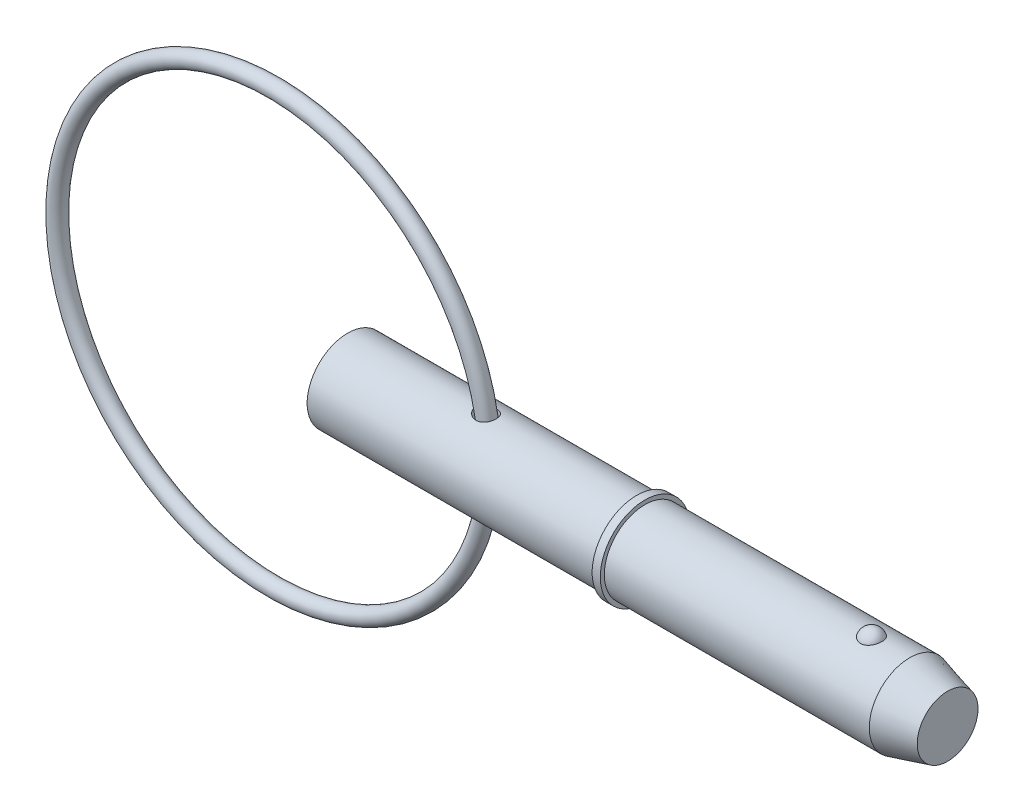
ISO-10303-21;
HEADER;
FILE_DESCRIPTION(('STEP AP214'),'2;1');
FILE_NAME('part.step','',(''),(''),'','','');
FILE_SCHEMA(('AUTOMOTIVE_DESIGN { 1 0 10303 214 1 1 1 1 }'));
ENDSEC;
DATA;
#1=APPLICATION_CONTEXT('core data for automotive mechanical design processes');
#2=APPLICATION_PROTOCOL_DEFINITION('international standard','automotive_design',2000,#1);
#3=PRODUCT_CONTEXT('',#1,'mechanical');
#4=PRODUCT('Part','Part','',(#3));
#5=PRODUCT_RELATED_PRODUCT_CATEGORY('part','',(#4));
#6=PRODUCT_DEFINITION_FORMATION('','',#4);
#7=PRODUCT_DEFINITION_CONTEXT('part definition',#1,'design');
#8=PRODUCT_DEFINITION('design','',#6,#7);
#9=PRODUCT_DEFINITION_SHAPE('','',#8);
#10=(LENGTH_UNIT() NAMED_UNIT(*) SI_UNIT(.MILLI.,.METRE.));
#11=(NAMED_UNIT(*) PLANE_ANGLE_UNIT() SI_UNIT($,.RADIAN.));
#12=(NAMED_UNIT(*) SI_UNIT($,.STERADIAN.) SOLID_ANGLE_UNIT());
#13=UNCERTAINTY_MEASURE_WITH_UNIT(LENGTH_MEASURE(1.E-05),#10,'distance_accuracy_value','');
#14=(GEOMETRIC_REPRESENTATION_CONTEXT(3) GLOBAL_UNCERTAINTY_ASSIGNED_CONTEXT((#13)) GLOBAL_UNIT_ASSIGNED_CONTEXT((#10,
#11,#12)) REPRESENTATION_CONTEXT('',''));
#15=CARTESIAN_POINT('',(0.,0.,0.));
#16=DIRECTION('',(0.,0.,1.));
#17=DIRECTION('',(1.,0.,0.));
#18=AXIS2_PLACEMENT_3D('',#15,#16,#17);
#19=CARTESIAN_POINT('',(-4.3552379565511,0.,0.));
#20=DIRECTION('',(0.,0.,1.));
#21=DIRECTION('',(1.,0.,0.));
#22=AXIS2_PLACEMENT_3D('',#19,#20,#21);
#23=TOROIDAL_SURFACE('',#22,12.7,0.476000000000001);
#24=CARTESIAN_POINT('',(8.8207620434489,0.,0.));
#25=VERTEX_POINT('',#24);
#26=VERTEX_LOOP('',#25);
#27=FACE_BOUND('',#26,.T.);
#28=ADVANCED_FACE('P0_F12',(#27),#23,.T.);
#29=CLOSED_SHELL('',(#28));
#30=MANIFOLD_SOLID_BREP('P0_B1',#29);
#31=CARTESIAN_POINT('',(0.,0.,0.));
#32=DIRECTION('',(1.,0.,0.));
#33=DIRECTION('',(0.,0.,-1.));
#34=AXIS2_PLACEMENT_3D('',#31,#32,#33);
#35=CYLINDRICAL_SURFACE('',#34,2.38);
#36=CARTESIAN_POINT('',(7.58975148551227,2.36313886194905,-0.28279801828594));
#37=CARTESIAN_POINT('',(7.6071494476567,2.3595137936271,-0.313086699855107));
#38=CARTESIAN_POINT('',(7.62722970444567,2.35548219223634,-0.341811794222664));
#39=CARTESIAN_POINT('',(7.6719764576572,2.34708028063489,-0.395416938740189));
#40=CARTESIAN_POINT('',(7.69665038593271,2.34270942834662,-0.420290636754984));
#41=CARTESIAN_POINT('',(7.74972661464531,2.33413422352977,-0.465561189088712));
#42=CARTESIAN_POINT('',(7.77811964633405,2.3299294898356,-0.485968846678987));
#43=CARTESIAN_POINT('',(7.83790446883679,2.32214293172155,-0.521911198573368));
#44=CARTESIAN_POINT('',(7.86929545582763,2.31856094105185,-0.537447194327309));
#45=CARTESIAN_POINT('',(7.93519088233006,2.31234960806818,-0.563583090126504));
#46=CARTESIAN_POINT('',(7.96975762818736,2.30974952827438,-0.574033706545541));
#47=CARTESIAN_POINT('',(8.04024488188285,2.3060008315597,-0.588914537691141));
#48=CARTESIAN_POINT('',(8.07616512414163,2.3048519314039,-0.593345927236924));
#49=CARTESIAN_POINT('',(8.14695871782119,2.30420789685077,-0.595841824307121));
#50=CARTESIAN_POINT('',(8.18182355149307,2.30465507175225,-0.594128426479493));
#51=CARTESIAN_POINT('',(8.25068512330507,2.30705630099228,-0.584734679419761));
#52=CARTESIAN_POINT('',(8.28468213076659,2.30900988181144,-0.577056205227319));
#53=CARTESIAN_POINT('',(8.34906698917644,2.31406811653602,-0.556412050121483));
#54=CARTESIAN_POINT('',(8.37955021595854,2.31711087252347,-0.543727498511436));
#55=CARTESIAN_POINT('',(8.43786372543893,2.32400968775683,-0.513438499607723));
#56=CARTESIAN_POINT('',(8.46569411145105,2.32786571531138,-0.495834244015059));
#57=CARTESIAN_POINT('',(8.51768626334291,2.33591620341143,-0.456393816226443));
#58=CARTESIAN_POINT('',(8.54188060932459,2.34010706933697,-0.434599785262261));
#59=CARTESIAN_POINT('',(8.58630752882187,2.34840208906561,-0.387277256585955));
#60=CARTESIAN_POINT('',(8.60653982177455,2.35250623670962,-0.361748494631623));
#61=CARTESIAN_POINT('',(8.64282785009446,2.36024850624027,-0.307237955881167));
#62=CARTESIAN_POINT('',(8.65881497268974,2.36387854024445,-0.278209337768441));
#63=CARTESIAN_POINT('',(8.68580879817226,2.37020506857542,-0.217827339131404));
#64=CARTESIAN_POINT('',(8.69681534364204,2.37290153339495,-0.18647388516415));
#65=CARTESIAN_POINT('',(8.71363969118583,2.37708738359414,-0.122079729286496));
#66=CARTESIAN_POINT('',(8.71941899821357,2.37856780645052,-0.0890283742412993));
#67=CARTESIAN_POINT('',(8.72550469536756,2.38012793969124,-0.0223933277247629));
#68=CARTESIAN_POINT('',(8.72581115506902,2.38020766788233,0.0111903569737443));
#69=CARTESIAN_POINT('',(8.72094957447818,2.37895941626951,0.0778527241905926));
#70=CARTESIAN_POINT('',(8.71579439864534,2.377634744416,0.110932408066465));
#71=CARTESIAN_POINT('',(8.70015845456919,2.37372548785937,0.175731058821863));
#72=CARTESIAN_POINT('',(8.68967753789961,2.37114086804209,0.207449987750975));
#73=CARTESIAN_POINT('',(8.66363496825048,2.36498751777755,0.268667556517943));
#74=CARTESIAN_POINT('',(8.64806773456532,2.36141770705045,0.298163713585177));
#75=CARTESIAN_POINT('',(8.61223946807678,2.35368505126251,0.354067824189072));
#76=CARTESIAN_POINT('',(8.59197833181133,2.34952219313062,0.380475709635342));
#77=CARTESIAN_POINT('',(8.54726357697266,2.34106443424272,0.429460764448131));
#78=CARTESIAN_POINT('',(8.52280850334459,2.33676948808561,0.452036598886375));
#79=CARTESIAN_POINT('',(8.47035669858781,2.3285376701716,0.49269040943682));
#80=CARTESIAN_POINT('',(8.44236041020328,2.32460075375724,0.510768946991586));
#81=CARTESIAN_POINT('',(8.38398546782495,2.31758529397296,0.541708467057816));
#82=CARTESIAN_POINT('',(8.35364184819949,2.31449641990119,0.554633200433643));
#83=CARTESIAN_POINT('',(8.29114127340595,2.30945817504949,0.575253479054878));
#84=CARTESIAN_POINT('',(8.25898451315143,2.30750868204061,0.582949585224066));
#85=CARTESIAN_POINT('',(8.19412910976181,2.30496641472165,0.592921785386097));
#86=CARTESIAN_POINT('',(8.161439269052,2.30436008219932,0.595252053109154));
#87=CARTESIAN_POINT('',(8.09610955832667,2.30450130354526,0.594704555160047));
#88=CARTESIAN_POINT('',(8.0634696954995,2.30524903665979,0.591826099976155));
#89=CARTESIAN_POINT('',(7.99825736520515,2.30802121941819,0.580921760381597));
#90=CARTESIAN_POINT('',(7.96570822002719,2.31007800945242,0.572765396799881));
#91=CARTESIAN_POINT('',(7.90235775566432,2.31524655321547,0.551500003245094));
#92=CARTESIAN_POINT('',(7.87155698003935,2.31835863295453,0.53838944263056));
#93=CARTESIAN_POINT('',(7.81084906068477,2.32548378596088,0.506755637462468));
#94=CARTESIAN_POINT('',(7.78107737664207,2.32953608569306,0.487980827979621));
#95=CARTESIAN_POINT('',(7.72506412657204,2.33797565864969,0.445793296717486));
#96=CARTESIAN_POINT('',(7.69882353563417,2.34236302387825,0.422379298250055));
#97=CARTESIAN_POINT('',(7.65019002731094,2.35106473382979,0.370927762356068));
#98=CARTESIAN_POINT('',(7.62788209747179,2.35537598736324,0.342808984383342));
#99=CARTESIAN_POINT('',(7.58861130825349,2.36331071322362,0.282967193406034));
#100=CARTESIAN_POINT('',(7.57164595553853,2.3669345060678,0.251245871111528));
#101=CARTESIAN_POINT('',(7.54465876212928,2.37284705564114,0.187017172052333));
#102=CARTESIAN_POINT('',(7.5342924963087,2.37520082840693,0.154660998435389));
#103=CARTESIAN_POINT('',(7.51954252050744,2.37858198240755,0.0885446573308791));
#104=CARTESIAN_POINT('',(7.51515589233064,2.37961001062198,0.0547851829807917));
#105=CARTESIAN_POINT('',(7.51270681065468,2.38018226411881,-0.0102367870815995));
#106=CARTESIAN_POINT('',(7.51416323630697,2.37983937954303,-0.0414812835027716));
#107=CARTESIAN_POINT('',(7.52225907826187,2.37796025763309,-0.103234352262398));
#108=CARTESIAN_POINT('',(7.52889419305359,2.37642501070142,-0.133743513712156));
#109=CARTESIAN_POINT('',(7.54430841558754,2.37294751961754,-0.184277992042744));
#110=CARTESIAN_POINT('',(7.55185254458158,2.37126438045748,-0.204709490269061));
#111=CARTESIAN_POINT('',(7.56916989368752,2.36748607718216,-0.244561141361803));
#112=CARTESIAN_POINT('',(7.57894307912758,2.36539091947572,-0.263981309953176));
#113=CARTESIAN_POINT('',(7.58975148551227,2.36313886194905,-0.28279801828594));
#114=B_SPLINE_CURVE_WITH_KNOTS('',3,(#36,#37,#38,#39,#40,#41,#42,#43,#44,#45,#46,#47,#48,#49,
#50,#51,#52,#53,#54,#55,#56,#57,#58,#59,#60,#61,#62,#63,#64,#65,#66,#67,#68,#69,#70,#71,#72,#73,
#74,#75,#76,#77,#78,#79,#80,#81,#82,#83,#84,#85,#86,#87,#88,#89,#90,#91,#92,#93,#94,#95,#96,#97,
#98,#99,#100,#101,#102,#103,#104,#105,#106,#107,#108,#109,#110,#111,#112,#113),.UNSPECIFIED.,
.T.,.F.,(4,2,2,2,2,2,2,2,2,2,2,2,2,2,2,2,2,2,2,2,2,2,2,2,2,2,2,2,2,2,2,2,2,2,2,2,2,2,4),(0.,
0.105267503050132,0.210706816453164,0.315888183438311,0.421041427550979,0.529118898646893,
0.637175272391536,0.741366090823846,0.84552417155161,0.944516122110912,1.04350421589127,
1.14154435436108,1.23959143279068,1.33913812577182,1.43868796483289,1.53896508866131,
1.63924093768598,1.73928111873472,1.83932408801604,1.93947719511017,2.03963250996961,
2.13982264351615,2.24000026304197,2.33889712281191,2.43778337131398,2.53566679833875,
2.63356318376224,2.73397729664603,2.83442245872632,2.94022921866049,3.04606513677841,
3.15396441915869,3.26181327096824,3.36343346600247,3.46500405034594,3.55839004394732,
3.65169855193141,3.71709653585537,3.78249350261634),.UNSPECIFIED.);
#115=CARTESIAN_POINT('',(7.58975148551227,2.36313886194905,-0.28279801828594));
#116=VERTEX_POINT('',#115);
#117=EDGE_CURVE('P1_E42',#116,#116,#114,.T.);
#118=ORIENTED_EDGE('',*,*,#117,.T.);
#119=EDGE_LOOP('',(#118));
#120=FACE_BOUND('',#119,.T.);
#121=CARTESIAN_POINT('',(0.,0.,0.));
#122=DIRECTION('',(1.,0.,0.));
#123=DIRECTION('',(0.,0.,-1.));
#124=AXIS2_PLACEMENT_3D('',#121,#122,#123);
#125=CIRCLE('',#124,2.38);
#126=CARTESIAN_POINT('',(0.,0.,-2.38));
#127=VERTEX_POINT('',#126);
#128=EDGE_CURVE('P1_E9',#127,#127,#125,.T.);
#129=ORIENTED_EDGE('',*,*,#128,.T.);
#130=EDGE_LOOP('',(#129));
#131=FACE_BOUND('',#130,.T.);
#132=CARTESIAN_POINT('',(16.974,0.,0.));
#133=DIRECTION('',(1.,0.,0.));
#134=DIRECTION('',(0.,0.,-1.));
#135=AXIS2_PLACEMENT_3D('',#132,#133,#134);
#136=CIRCLE('',#135,2.38);
#137=CARTESIAN_POINT('',(16.974,0.,-2.38));
#138=VERTEX_POINT('',#137);
#139=EDGE_CURVE('P1_E25',#138,#138,#136,.T.);
#140=ORIENTED_EDGE('',*,*,#139,.F.);
#141=EDGE_LOOP('',(#140));
#142=FACE_BOUND('',#141,.T.);
#143=CARTESIAN_POINT('',(7.58975148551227,-2.36313886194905,-0.28279801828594));
#144=CARTESIAN_POINT('',(7.57418830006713,-2.3663814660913,-0.255701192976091));
#145=CARTESIAN_POINT('',(7.56076205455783,-2.36930044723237,-0.227336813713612));
#146=CARTESIAN_POINT('',(7.53869583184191,-2.37419355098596,-0.168724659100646));
#147=CARTESIAN_POINT('',(7.53005409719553,-2.37616802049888,-0.138477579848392));
#148=CARTESIAN_POINT('',(7.5179268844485,-2.37895970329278,-0.0768369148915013));
#149=CARTESIAN_POINT('',(7.51445304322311,-2.37977430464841,-0.0454409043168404));
#150=CARTESIAN_POINT('',(7.51287156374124,-2.38014365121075,0.0174935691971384));
#151=CARTESIAN_POINT('',(7.51476360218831,-2.37969847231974,0.0490320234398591));
#152=CARTESIAN_POINT('',(7.52368198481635,-2.37763188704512,0.11036883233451));
#153=CARTESIAN_POINT('',(7.53055435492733,-2.37604576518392,0.140191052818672));
#154=CARTESIAN_POINT('',(7.54895588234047,-2.37190466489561,0.19828599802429));
#155=CARTESIAN_POINT('',(7.56048572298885,-2.36934954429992,0.226558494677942));
#156=CARTESIAN_POINT('',(7.58819257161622,-2.36343089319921,0.281762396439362));
#157=CARTESIAN_POINT('',(7.60450508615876,-2.36004434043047,0.308623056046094));
#158=CARTESIAN_POINT('',(7.64106334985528,-2.35283977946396,0.359451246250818));
#159=CARTESIAN_POINT('',(7.6613104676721,-2.34902162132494,0.383417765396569));
#160=CARTESIAN_POINT('',(7.70695754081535,-2.34099193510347,0.429832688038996));
#161=CARTESIAN_POINT('',(7.73264232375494,-2.33677362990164,0.45200004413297));
#162=CARTESIAN_POINT('',(7.78725305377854,-2.32868304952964,0.491988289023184));
#163=CARTESIAN_POINT('',(7.81618023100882,-2.32481090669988,0.509807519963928));
#164=CARTESIAN_POINT('',(7.87824201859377,-2.31763132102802,0.541539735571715));
#165=CARTESIAN_POINT('',(7.91152093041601,-2.31436703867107,0.555181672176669));
#166=CARTESIAN_POINT('',(7.97999150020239,-2.30909873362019,0.576703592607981));
#167=CARTESIAN_POINT('',(8.01518292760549,-2.30709455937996,0.584584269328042));
#168=CARTESIAN_POINT('',(8.08580757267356,-2.30465743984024,0.594119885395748));
#169=CARTESIAN_POINT('',(8.12122470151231,-2.30419653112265,0.595885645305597));
#170=CARTESIAN_POINT('',(8.19181659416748,-2.30486796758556,0.593284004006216));
#171=CARTESIAN_POINT('',(8.22699144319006,-2.30599972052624,0.588918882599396));
#172=CARTESIAN_POINT('',(8.29408987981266,-2.30963941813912,0.574470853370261));
#173=CARTESIAN_POINT('',(8.32608666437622,-2.31207030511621,0.564707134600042));
#174=CARTESIAN_POINT('',(8.38787213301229,-2.31798180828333,0.539927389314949));
#175=CARTESIAN_POINT('',(8.41766103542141,-2.32146232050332,0.524911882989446));
#176=CARTESIAN_POINT('',(8.47353661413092,-2.32898511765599,0.490439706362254));
#177=CARTESIAN_POINT('',(8.49969091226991,-2.33301318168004,0.471089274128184));
#178=CARTESIAN_POINT('',(8.54838372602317,-2.34124455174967,0.428307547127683));
#179=CARTESIAN_POINT('',(8.57092204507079,-2.34544786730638,0.404876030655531));
#180=CARTESIAN_POINT('',(8.61207557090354,-2.35362667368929,0.354267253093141));
#181=CARTESIAN_POINT('',(8.63063940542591,-2.35759874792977,0.3270476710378));
#182=CARTESIAN_POINT('',(8.66303816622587,-2.36482918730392,0.269839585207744));
#183=CARTESIAN_POINT('',(8.67687284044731,-2.36808751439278,0.23985093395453));
#184=CARTESIAN_POINT('',(8.69960621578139,-2.37357381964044,0.177579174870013));
#185=CARTESIAN_POINT('',(8.7084473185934,-2.3757897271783,0.145273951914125));
#186=CARTESIAN_POINT('',(8.72072898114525,-2.37889592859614,0.0795911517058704));
#187=CARTESIAN_POINT('',(8.72416959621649,-2.37978623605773,0.0462135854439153));
#188=CARTESIAN_POINT('',(8.72556332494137,-2.38014500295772,-0.0206284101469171));
#189=CARTESIAN_POINT('',(8.72352221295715,-2.37961495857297,-0.0540927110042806));
#190=CARTESIAN_POINT('',(8.71401607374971,-2.37719332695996,-0.12019135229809));
#191=CARTESIAN_POINT('',(8.70655097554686,-2.37530172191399,-0.152825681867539));
#192=CARTESIAN_POINT('',(8.68638818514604,-2.37036240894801,-0.216324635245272));
#193=CARTESIAN_POINT('',(8.67369312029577,-2.36731528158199,-0.247190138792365));
#194=CARTESIAN_POINT('',(8.64338307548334,-2.36039503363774,-0.306303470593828));
#195=CARTESIAN_POINT('',(8.62576790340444,-2.35652188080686,-0.334551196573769));
#196=CARTESIAN_POINT('',(8.58601062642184,-2.34836581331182,-0.387689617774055));
#197=CARTESIAN_POINT('',(8.56385884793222,-2.34408203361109,-0.412572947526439));
#198=CARTESIAN_POINT('',(8.51562034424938,-2.33559361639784,-0.458194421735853));
#199=CARTESIAN_POINT('',(8.4895339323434,-2.33138897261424,-0.478932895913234));
#200=CARTESIAN_POINT('',(8.43437902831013,-2.32357677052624,-0.515498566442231));
#201=CARTESIAN_POINT('',(8.40533919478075,-2.31996422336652,-0.531367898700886));
#202=CARTESIAN_POINT('',(8.3449114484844,-2.31370413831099,-0.557997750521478));
#203=CARTESIAN_POINT('',(8.31352388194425,-2.31105645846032,-0.568759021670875));
#204=CARTESIAN_POINT('',(8.24979053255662,-2.30704987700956,-0.584798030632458));
#205=CARTESIAN_POINT('',(8.2174653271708,-2.30567279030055,-0.590153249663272));
#206=CARTESIAN_POINT('',(8.15234941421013,-2.3042717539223,-0.595600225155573));
#207=CARTESIAN_POINT('',(8.11955868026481,-2.30424788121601,-0.595691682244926));
#208=CARTESIAN_POINT('',(8.05396041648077,-2.30553291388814,-0.590698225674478));
#209=CARTESIAN_POINT('',(8.02115865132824,-2.30685983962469,-0.585543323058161));
#210=CARTESIAN_POINT('',(7.95682322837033,-2.31069752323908,-0.570209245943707));
#211=CARTESIAN_POINT('',(7.9252899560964,-2.31320863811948,-0.560028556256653));
#212=CARTESIAN_POINT('',(7.86270639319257,-2.31927991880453,-0.534343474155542));
#213=CARTESIAN_POINT('',(7.83175966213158,-2.32288638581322,-0.51859766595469));
#214=CARTESIAN_POINT('',(7.7728658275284,-2.33068292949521,-0.48234820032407));
#215=CARTESIAN_POINT('',(7.74491930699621,-2.33487311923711,-0.461843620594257));
#216=CARTESIAN_POINT('',(7.69322838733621,-2.34330635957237,-0.416926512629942));
#217=CARTESIAN_POINT('',(7.66941974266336,-2.34754724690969,-0.392587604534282));
#218=CARTESIAN_POINT('',(7.62614930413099,-2.35569931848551,-0.340264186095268));
#219=CARTESIAN_POINT('',(7.60668542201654,-2.35961066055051,-0.312281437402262));
#220=CARTESIAN_POINT('',(7.58975148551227,-2.36313886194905,-0.28279801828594));
#221=B_SPLINE_CURVE_WITH_KNOTS('',3,(#143,#144,#145,#146,#147,#148,#149,#150,#151,#152,#153,
#154,#155,#156,#157,#158,#159,#160,#161,#162,#163,#164,#165,#166,#167,#168,#169,#170,#171,#172,
#173,#174,#175,#176,#177,#178,#179,#180,#181,#182,#183,#184,#185,#186,#187,#188,#189,#190,#191,
#192,#193,#194,#195,#196,#197,#198,#199,#200,#201,#202,#203,#204,#205,#206,#207,#208,#209,#210,
#211,#212,#213,#214,#215,#216,#217,#218,#219,#220),.UNSPECIFIED.,.T.,.F.,(4,2,2,2,2,2,2,2,2,2,2,
2,2,2,2,2,2,2,2,2,2,2,2,2,2,2,2,2,2,2,2,2,2,2,2,2,2,2,4),(0.,0.0941407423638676,
0.188246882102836,0.282564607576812,0.376876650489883,0.468390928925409,0.559918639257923,
0.654342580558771,0.748799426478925,0.850921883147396,0.953083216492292,1.06090345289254,
1.16871071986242,1.2745536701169,1.38035727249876,1.48048681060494,1.58060643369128,
1.67849861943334,1.7763961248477,1.87549138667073,1.97459192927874,2.07481335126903,
2.17503374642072,2.27514861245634,2.37526478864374,2.47533073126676,2.57540058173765,
2.67568607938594,2.77596359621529,2.87534713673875,2.97471604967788,3.07263964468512,
3.17056880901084,3.26982174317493,3.36910461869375,3.47336737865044,3.57765036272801,
3.68013205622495,3.78256438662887),.UNSPECIFIED.);
#222=CARTESIAN_POINT('',(7.58975148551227,-2.36313886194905,-0.28279801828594));
#223=VERTEX_POINT('',#222);
#224=EDGE_CURVE('P1_E17',#223,#223,#221,.T.);
#225=ORIENTED_EDGE('',*,*,#224,.T.);
#226=EDGE_LOOP('',(#225));
#227=FACE_BOUND('',#226,.T.);
#228=ADVANCED_FACE('P1_F13',(#120,#131,#142,#227),#35,.T.);
#229=CARTESIAN_POINT('',(0.,0.,0.));
#230=DIRECTION('',(1.,0.,0.));
#231=DIRECTION('',(0.,0.,-1.));
#232=AXIS2_PLACEMENT_3D('',#229,#230,#231);
#233=CYLINDRICAL_SURFACE('',#232,2.38);
#234=CARTESIAN_POINT('',(33.0094297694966,0.,0.));
#235=DIRECTION('',(1.,0.,0.));
#236=DIRECTION('',(0.,0.,-1.));
#237=AXIS2_PLACEMENT_3D('',#234,#235,#236);
#238=CIRCLE('',#237,2.38);
#239=CARTESIAN_POINT('',(33.0094297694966,0.,-2.38));
#240=VERTEX_POINT('',#239);
#241=EDGE_CURVE('P1_E99',#240,#240,#238,.T.);
#242=ORIENTED_EDGE('',*,*,#241,.F.);
#243=EDGE_LOOP('',(#242));
#244=FACE_BOUND('',#243,.T.);
#245=CARTESIAN_POINT('',(17.45,0.,0.));
#246=DIRECTION('',(1.,0.,0.));
#247=DIRECTION('',(0.,0.,-1.));
#248=AXIS2_PLACEMENT_3D('',#245,#246,#247);
#249=CIRCLE('',#248,2.38);
#250=CARTESIAN_POINT('',(17.45,0.,-2.38));
#251=VERTEX_POINT('',#250);
#252=EDGE_CURVE('P1_E96',#251,#251,#249,.T.);
#253=ORIENTED_EDGE('',*,*,#252,.T.);
#254=EDGE_LOOP('',(#253));
#255=FACE_BOUND('',#254,.T.);
#256=CARTESIAN_POINT('',(30.7634492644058,2.2921568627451,0.640637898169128));
#257=CARTESIAN_POINT('',(30.7303559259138,2.29215737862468,0.640637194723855));
#258=CARTESIAN_POINT('',(30.6972546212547,2.29293179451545,0.637884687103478));
#259=CARTESIAN_POINT('',(30.6320176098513,2.29594030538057,0.626968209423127));
#260=CARTESIAN_POINT('',(30.5998823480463,2.29817506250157,0.618801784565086));
#261=CARTESIAN_POINT('',(30.5375402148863,2.30384308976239,0.597351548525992));
#262=CARTESIAN_POINT('',(30.5073305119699,2.30727454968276,0.584075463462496));
#263=CARTESIAN_POINT('',(30.4495674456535,2.31495941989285,0.55282960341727));
#264=CARTESIAN_POINT('',(30.4220141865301,2.31921286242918,0.534859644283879));
#265=CARTESIAN_POINT('',(30.3695938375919,2.32820213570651,0.494282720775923));
#266=CARTESIAN_POINT('',(30.3448050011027,2.33294694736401,0.47157679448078));
#267=CARTESIAN_POINT('',(30.2992169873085,2.34234144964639,0.422446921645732));
#268=CARTESIAN_POINT('',(30.2784185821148,2.34699112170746,0.396022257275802));
#269=CARTESIAN_POINT('',(30.2403580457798,2.35593942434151,0.338855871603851));
#270=CARTESIAN_POINT('',(30.2233051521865,2.36021170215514,0.307970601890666));
#271=CARTESIAN_POINT('',(30.1943607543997,2.3677057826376,0.243750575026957));
#272=CARTESIAN_POINT('',(30.1824701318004,2.37092740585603,0.210415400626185));
#273=CARTESIAN_POINT('',(30.1638076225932,2.37606901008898,0.141189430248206));
#274=CARTESIAN_POINT('',(30.1571956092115,2.37794816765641,0.105252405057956));
#275=CARTESIAN_POINT('',(30.1498095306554,2.38005135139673,0.0327351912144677));
#276=CARTESIAN_POINT('',(30.1490358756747,2.38027526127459,-0.00384504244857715));
#277=CARTESIAN_POINT('',(30.1533628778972,2.37903842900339,-0.0769838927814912));
#278=CARTESIAN_POINT('',(30.1585202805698,2.37756141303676,-0.113538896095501));
#279=CARTESIAN_POINT('',(30.1747013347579,2.37305303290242,-0.18522921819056));
#280=CARTESIAN_POINT('',(30.1857251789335,2.37002161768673,-0.22036449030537));
#281=CARTESIAN_POINT('',(30.2133977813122,2.36273722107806,-0.288156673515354));
#282=CARTESIAN_POINT('',(30.2300389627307,2.35848588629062,-0.320816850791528));
#283=CARTESIAN_POINT('',(30.2685984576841,2.34923130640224,-0.382744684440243));
#284=CARTESIAN_POINT('',(30.290516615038,2.34422808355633,-0.412012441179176));
#285=CARTESIAN_POINT('',(30.3387549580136,2.33412555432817,-0.465830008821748));
#286=CARTESIAN_POINT('',(30.365002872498,2.32902887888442,-0.490444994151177));
#287=CARTESIAN_POINT('',(30.4214769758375,2.31926941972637,-0.534700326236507));
#288=CARTESIAN_POINT('',(30.451702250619,2.3146065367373,-0.554341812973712));
#289=CARTESIAN_POINT('',(30.5140618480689,2.30645675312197,-0.587312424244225));
#290=CARTESIAN_POINT('',(30.5460780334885,2.30293152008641,-0.600855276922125));
#291=CARTESIAN_POINT('',(30.6120795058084,2.29725171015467,-0.622220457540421));
#292=CARTESIAN_POINT('',(30.6460641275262,2.29509667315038,-0.630044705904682));
#293=CARTESIAN_POINT('',(30.713299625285,2.29249264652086,-0.639452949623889));
#294=CARTESIAN_POINT('',(30.7465087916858,2.29196755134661,-0.641315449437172));
#295=CARTESIAN_POINT('',(30.812763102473,2.29246849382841,-0.639522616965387));
#296=CARTESIAN_POINT('',(30.8458082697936,2.29349430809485,-0.635868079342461));
#297=CARTESIAN_POINT('',(30.9101025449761,2.29694059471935,-0.623301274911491));
#298=CARTESIAN_POINT('',(30.9413744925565,2.29933234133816,-0.614497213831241));
#299=CARTESIAN_POINT('',(31.0019952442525,2.30522511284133,-0.592006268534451));
#300=CARTESIAN_POINT('',(31.0313438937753,2.30872622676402,-0.578318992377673));
#301=CARTESIAN_POINT('',(31.0880369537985,2.31655795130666,-0.546112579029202));
#302=CARTESIAN_POINT('',(31.115320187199,2.32090569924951,-0.527490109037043));
#303=CARTESIAN_POINT('',(31.1664904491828,2.32992206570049,-0.486117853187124));
#304=CARTESIAN_POINT('',(31.1903767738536,2.33459075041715,-0.463367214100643));
#305=CARTESIAN_POINT('',(31.2352722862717,2.34399834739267,-0.413220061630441));
#306=CARTESIAN_POINT('',(31.2560972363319,2.34873051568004,-0.385657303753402));
#307=CARTESIAN_POINT('',(31.293056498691,2.35754932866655,-0.327455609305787));
#308=CARTESIAN_POINT('',(31.3091898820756,2.36163584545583,-0.296816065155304));
#309=CARTESIAN_POINT('',(31.3369822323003,2.36889321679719,-0.232047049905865));
#310=CARTESIAN_POINT('',(31.3484450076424,2.37202275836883,-0.197828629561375));
#311=CARTESIAN_POINT('',(31.3657523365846,2.37681926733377,-0.127900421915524));
#312=CARTESIAN_POINT('',(31.3715962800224,2.37848607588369,-0.0921904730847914));
#313=CARTESIAN_POINT('',(31.377605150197,2.38020024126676,-0.0196348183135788));
#314=CARTESIAN_POINT('',(31.3776704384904,2.38021918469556,0.0172198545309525));
#315=CARTESIAN_POINT('',(31.3718689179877,2.37856356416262,0.0904219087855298));
#316=CARTESIAN_POINT('',(31.3660018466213,2.37688892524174,0.126769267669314));
#317=CARTESIAN_POINT('',(31.348425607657,2.37201688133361,0.198028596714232));
#318=CARTESIAN_POINT('',(31.336699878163,2.36881516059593,0.232936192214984));
#319=CARTESIAN_POINT('',(31.3076354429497,2.36123444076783,0.300196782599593));
#320=CARTESIAN_POINT('',(31.2902967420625,2.3568554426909,0.332549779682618));
#321=CARTESIAN_POINT('',(31.2505350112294,2.34744667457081,0.393495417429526));
#322=CARTESIAN_POINT('',(31.2281528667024,2.34242227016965,0.422115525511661));
#323=CARTESIAN_POINT('',(31.1787391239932,2.33227293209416,0.475004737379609));
#324=CARTESIAN_POINT('',(31.1517076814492,2.32714800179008,0.499273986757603));
#325=CARTESIAN_POINT('',(31.0944988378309,2.31755359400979,0.542046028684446));
#326=CARTESIAN_POINT('',(31.0644297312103,2.31306986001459,0.560690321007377));
#327=CARTESIAN_POINT('',(31.0013869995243,2.3051412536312,0.592447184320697));
#328=CARTESIAN_POINT('',(30.9684158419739,2.30169550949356,0.605564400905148));
#329=CARTESIAN_POINT('',(30.9068424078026,2.29677744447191,0.623927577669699));
#330=CARTESIAN_POINT('',(30.8785555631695,2.29505839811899,0.630178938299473));
#331=CARTESIAN_POINT('',(30.8213308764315,2.29274795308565,0.638534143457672));
#332=CARTESIAN_POINT('',(30.7923931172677,2.29215641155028,0.64063851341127));
#333=CARTESIAN_POINT('',(30.7634492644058,2.2921568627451,0.640637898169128));
#334=B_SPLINE_CURVE_WITH_KNOTS('',3,(#256,#257,#258,#259,#260,#261,#262,#263,#264,#265,#266,
#267,#268,#269,#270,#271,#272,#273,#274,#275,#276,#277,#278,#279,#280,#281,#282,#283,#284,#285,
#286,#287,#288,#289,#290,#291,#292,#293,#294,#295,#296,#297,#298,#299,#300,#301,#302,#303,#304,
#305,#306,#307,#308,#309,#310,#311,#312,#313,#314,#315,#316,#317,#318,#319,#320,#321,#322,#323,
#324,#325,#326,#327,#328,#329,#330,#331,#332,#333),.UNSPECIFIED.,.T.,.F.,(4,2,2,2,2,2,2,2,2,2,2,
2,2,2,2,2,2,2,2,2,2,2,2,2,2,2,2,2,2,2,2,2,2,2,2,2,2,2,4),(0.,0.099172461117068,
0.198389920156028,0.297457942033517,0.396529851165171,0.497927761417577,0.599345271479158,
0.705475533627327,0.811623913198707,0.920876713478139,1.03013718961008,1.14045177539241,
1.25076998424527,1.3609399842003,1.47110672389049,1.57959248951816,1.68805336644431,
1.79234266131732,1.89659691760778,1.99590391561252,2.0951966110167,2.19247425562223,
2.28975970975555,2.38926978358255,2.48880044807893,2.5929358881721,2.69709193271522,
2.80525821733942,2.91343624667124,3.02347917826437,3.13352698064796,3.24388765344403,
3.35424823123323,3.46374443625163,3.57323697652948,3.67968690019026,3.78604717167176,
3.87279565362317,3.95953314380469),.UNSPECIFIED.);
#335=CARTESIAN_POINT('',(30.7634492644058,2.2921568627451,0.640637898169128));
#336=VERTEX_POINT('',#335);
#337=EDGE_CURVE('P1_E34',#336,#336,#334,.T.);
#338=ORIENTED_EDGE('',*,*,#337,.T.);
#339=EDGE_LOOP('',(#338));
#340=FACE_BOUND('',#339,.T.);
#341=ADVANCED_FACE('P1_F46',(#244,#255,#340),#233,.T.);
#342=CARTESIAN_POINT('',(0.,0.,0.));
#343=DIRECTION('',(-1.,0.,0.));
#344=DIRECTION('',(0.,0.,1.));
#345=AXIS2_PLACEMENT_3D('',#342,#343,#344);
#346=PLANE('',#345);
#347=ORIENTED_EDGE('',*,*,#128,.F.);
#348=EDGE_LOOP('',(#347));
#349=FACE_BOUND('',#348,.T.);
#350=ADVANCED_FACE('P1_F15',(#349),#346,.T.);
#351=CARTESIAN_POINT('',(16.974,2.38,0.));
#352=DIRECTION('',(-1.,0.,0.));
#353=DIRECTION('',(0.,0.,1.));
#354=AXIS2_PLACEMENT_3D('',#351,#352,#353);
#355=PLANE('',#354);
#356=ORIENTED_EDGE('',*,*,#139,.T.);
#357=EDGE_LOOP('',(#356));
#358=FACE_BOUND('',#357,.T.);
#359=CARTESIAN_POINT('',(16.974,0.,0.));
#360=DIRECTION('',(1.,0.,0.));
#361=DIRECTION('',(0.,0.,-1.));
#362=AXIS2_PLACEMENT_3D('',#359,#360,#361);
#363=CIRCLE('',#362,2.618);
#364=CARTESIAN_POINT('',(16.974,0.,-2.618));
#365=VERTEX_POINT('',#364);
#366=EDGE_CURVE('P1_E30',#365,#365,#363,.T.);
#367=ORIENTED_EDGE('',*,*,#366,.F.);
#368=EDGE_LOOP('',(#367));
#369=FACE_BOUND('',#368,.T.);
#370=ADVANCED_FACE('P1_F81',(#358,#369),#355,.T.);
#371=CARTESIAN_POINT('',(0.,0.,0.));
#372=DIRECTION('',(1.,0.,0.));
#373=DIRECTION('',(0.,0.,-1.));
#374=AXIS2_PLACEMENT_3D('',#371,#372,#373);
#375=CYLINDRICAL_SURFACE('',#374,2.618);
#376=ORIENTED_EDGE('',*,*,#366,.T.);
#377=EDGE_LOOP('',(#376));
#378=FACE_BOUND('',#377,.T.);
#379=CARTESIAN_POINT('',(17.45,0.,0.));
#380=DIRECTION('',(1.,0.,0.));
#381=DIRECTION('',(0.,0.,-1.));
#382=AXIS2_PLACEMENT_3D('',#379,#380,#381);
#383=CIRCLE('',#382,2.618);
#384=CARTESIAN_POINT('',(17.45,0.,-2.618));
#385=VERTEX_POINT('',#384);
#386=EDGE_CURVE('P1_E95',#385,#385,#383,.T.);
#387=ORIENTED_EDGE('',*,*,#386,.F.);
#388=EDGE_LOOP('',(#387));
#389=FACE_BOUND('',#388,.T.);
#390=ADVANCED_FACE('P1_F68',(#378,#389),#375,.T.);
#391=CARTESIAN_POINT('',(17.45,2.618,0.));
#392=DIRECTION('',(1.,0.,0.));
#393=DIRECTION('',(0.,0.,-1.));
#394=AXIS2_PLACEMENT_3D('',#391,#392,#393);
#395=PLANE('',#394);
#396=ORIENTED_EDGE('',*,*,#386,.T.);
#397=EDGE_LOOP('',(#396));
#398=FACE_BOUND('',#397,.T.);
#399=ORIENTED_EDGE('',*,*,#252,.F.);
#400=EDGE_LOOP('',(#399));
#401=FACE_BOUND('',#400,.T.);
#402=ADVANCED_FACE('P1_F62',(#398,#401),#395,.T.);
#403=CARTESIAN_POINT('',(35.23,0.,0.));
#404=DIRECTION('',(-1.,0.,0.));
#405=DIRECTION('',(0.,0.,1.));
#406=AXIS2_PLACEMENT_3D('',#403,#404,#405);
#407=CONICAL_SURFACE('',#406,1.785,0.261799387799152);
#408=ORIENTED_EDGE('',*,*,#241,.T.);
#409=EDGE_LOOP('',(#408));
#410=FACE_BOUND('',#409,.T.);
#411=CARTESIAN_POINT('',(35.23,0.,0.));
#412=DIRECTION('',(1.,0.,0.));
#413=DIRECTION('',(0.,0.,-1.));
#414=AXIS2_PLACEMENT_3D('',#411,#412,#413);
#415=CIRCLE('',#414,1.785);
#416=CARTESIAN_POINT('',(35.23,0.,-1.785));
#417=VERTEX_POINT('',#416);
#418=EDGE_CURVE('P1_E41',#417,#417,#415,.T.);
#419=ORIENTED_EDGE('',*,*,#418,.F.);
#420=EDGE_LOOP('',(#419));
#421=FACE_BOUND('',#420,.T.);
#422=ADVANCED_FACE('P1_F59',(#410,#421),#407,.T.);
#423=CARTESIAN_POINT('',(35.23,1.785,0.));
#424=DIRECTION('',(1.,0.,0.));
#425=DIRECTION('',(0.,0.,-1.));
#426=AXIS2_PLACEMENT_3D('',#423,#424,#425);
#427=PLANE('',#426);
#428=ORIENTED_EDGE('',*,*,#418,.T.);
#429=EDGE_LOOP('',(#428));
#430=FACE_BOUND('',#429,.T.);
#431=ADVANCED_FACE('P1_F55',(#430),#427,.T.);
#432=CARTESIAN_POINT('',(30.7634492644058,2.142,0.));
#433=DIRECTION('',(-1.,0.,0.));
#434=DIRECTION('',(0.,1.,0.));
#435=AXIS2_PLACEMENT_3D('',#432,#433,#434);
#436=SPHERICAL_SURFACE('',#435,0.658000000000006);
#437=ORIENTED_EDGE('',*,*,#337,.F.);
#438=EDGE_LOOP('',(#437));
#439=FACE_BOUND('',#438,.T.);
#440=ADVANCED_FACE('P1_F50',(#439),#436,.T.);
#441=CARTESIAN_POINT('',(-4.3552379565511,0.,0.));
#442=DIRECTION('',(0.,0.,1.));
#443=DIRECTION('',(1.,0.,0.));
#444=AXIS2_PLACEMENT_3D('',#441,#442,#443);
#445=TOROIDAL_SURFACE('',#444,12.7,0.594999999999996);
#446=ORIENTED_EDGE('',*,*,#224,.F.);
#447=EDGE_LOOP('',(#446));
#448=FACE_BOUND('',#447,.T.);
#449=ORIENTED_EDGE('',*,*,#117,.F.);
#450=EDGE_LOOP('',(#449));
#451=FACE_BOUND('',#450,.T.);
#452=ADVANCED_FACE('P1_F54',(#448,#451),#445,.F.);
#453=CLOSED_SHELL('',(#228,#341,#350,#370,#390,#402,#422,#431,#440,#452));
#454=MANIFOLD_SOLID_BREP('P1_B1',#453);
#455=ADVANCED_BREP_SHAPE_REPRESENTATION('',(#18,#30,#454),#14);
#456=SHAPE_DEFINITION_REPRESENTATION(#9,#455);
ENDSEC;
END-ISO-10303-21;
